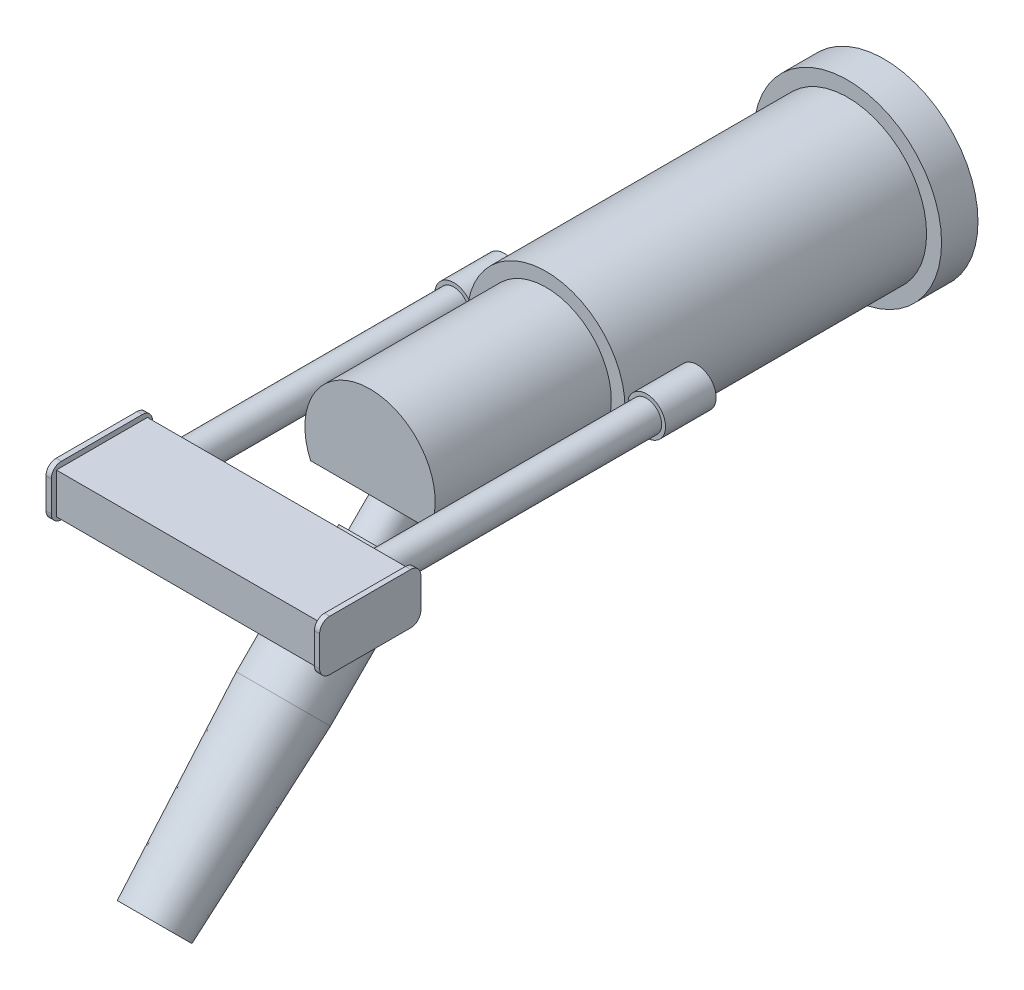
from build123d import *

# Parameters (mm, degrees)
SKETCH1_R          = 58.928
EXTRUDE1_DEPTH     = 22.86
SKETCH2_R          = 49.53
EXTRUDE2_DEPTH     = 189.23
SKETCH3_R          = 40.894
EXTRUDE3_DEPTH     = 110.49
SKETCH4_R          = 28.0035
CUT_EXTRUDE1_DEPTH = 77.851
SKETCH10_R         = 11.938
EXTRUDE9_DEPTH     = 31.75
SKETCH7_R          = 9.525
EXTRUDE6_DEPTH     = 170.18
SKETCH8_W          = 165.1
SKETCH8_H          = 25.4
EXTRUDE7_DEPTH     = 57.15
EXTRUDE8_DEPTH     = 3.302
CUT_EXTRUDE2_START = -37.299967
CUT_EXTRUDE2_DEPTH = 74.599934


with BuildPart() as part:
    # Sketch1 → Extrude1 (new body)
    with BuildSketch(Plane.XY):
        Circle(SKETCH1_R)
    extrude(amount=EXTRUDE1_DEPTH)

    # Sketch2 → Extrude2 (add)
    with BuildSketch(Plane.XY.offset(22.86)):
        Circle(SKETCH2_R)
    extrude(amount=EXTRUDE2_DEPTH)

    # Sketch4 → Cut-Extrude1 (cut)
    with BuildSketch(Plane(origin=(0, 0, 0), x_dir=(-1, 0, 0), z_dir=(0, 0, -1))):
        Circle(SKETCH4_R)
    extrude(amount=-CUT_EXTRUDE1_DEPTH, mode=Mode.SUBTRACT)


with BuildPart() as body_2:
    # Sketch3 → Extrude3 (new body)
    with BuildSketch(Plane.XY.offset(212.09)):
        Circle(SKETCH3_R)
    extrude(amount=EXTRUDE3_DEPTH)

    # Sketch11 → Cut-Extrude2 (cut)
    with BuildSketch(Plane(origin=(0, 0, 0), x_dir=(0, 0, -1), z_dir=(1, 0, 0)).offset(CUT_EXTRUDE2_START)):
        Polygon((-324.559129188, -14.784870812), (-298.45, -40.894), (-324.559129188, -40.894), align=None)
    extrude(amount=CUT_EXTRUDE2_DEPTH, mode=Mode.SUBTRACT)


with BuildPart() as body_3:
    # Sketch10 → Extrude9 (new body)
    with BuildSketch(Plane.XY.offset(177.8)):
        with Locations((60.452, 0)):
            Circle(SKETCH10_R)
    extrude(amount=EXTRUDE9_DEPTH)


with BuildPart() as body_4:
    # Sketch7 → Extrude6 (new body)
    with BuildSketch(Plane.XY.offset(209.55)):
        with Locations((60.452, 0)):
            Circle(SKETCH7_R)
    extrude(amount=EXTRUDE6_DEPTH)


with BuildPart() as body_5:
    # Sketch8 → Extrude7 (new body)
    with BuildSketch(Plane.XY.offset(379.73)):
        Rectangle(SKETCH8_W, SKETCH8_H)
    extrude(amount=EXTRUDE7_DEPTH)


with BuildPart() as body_6:
    # Sketch9 → Extrude8 (new body)
    with BuildSketch(Plane(origin=(82.55, 0, 0), x_dir=(0, 0, -1), z_dir=(1, 0, 0))):
        with BuildLine():
            Line((-376.555, -9.525), (-376.555, 9.525))
            ThreePointArc((-376.555, 9.525), (-378.414871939, 14.015128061), (-382.905, 15.875))
            Line((-382.905, 15.875), (-433.705, 15.875))
            ThreePointArc((-433.705, 15.875), (-438.195128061, 14.015128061), (-440.055, 9.525))
            Line((-440.055, 9.525), (-440.055, -9.525))
            ThreePointArc((-440.055, -9.525), (-438.195128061, -14.015128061), (-433.705, -15.875))
            Line((-433.705, -15.875), (-382.905, -15.875))
            ThreePointArc((-382.905, -15.875), (-378.414871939, -14.015128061), (-376.555, -9.525))
        make_face()
    extrude(amount=EXTRUDE8_DEPTH)


with BuildPart() as body_7:
    # Mirror1: mirrored copy
    add(body_3.part.mirror(Plane(origin=(0, 0, 0), x_dir=(0, 0, 1), z_dir=(1, 0, 0))))


with BuildPart() as body_8:
    # Mirror1 2: mirrored copy
    add(body_4.part.mirror(Plane(origin=(0, 0, 0), x_dir=(0, 0, 1), z_dir=(1, 0, 0))))


with BuildPart() as body_9:
    # Mirror1 3: mirrored copy
    add(body_6.part.mirror(Plane(origin=(0, 0, 0), x_dir=(0, 0, 1), z_dir=(1, 0, 0))))


with BuildPart() as body_10:
    # Sketch12 → Revolve1 (revolve)
    with BuildSketch(Plane(origin=(0, 0, 0), x_dir=(0, 0, -1), z_dir=(1, 0, 0)), mode=Mode.PRIVATE) as revolve1_sk:
        Polygon((-307.34, -30.8356), (-457.759290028, -181.254890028), (-471.292998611, -167.721181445), (-393.999471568, -83.370098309), (-340.117934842, -29.488561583), (-335.403300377, -34.203196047), (-333.158236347, -31.958132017), (-329.700837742, -35.415530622), (-316.23045356, -21.94514644), align=None)
    revolve(revolve1_sk.sketch.rotate(Axis((0, -100.432584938, 376.936984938), (0, 0.7071067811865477, -0.7071067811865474)), 180), axis=Axis((0, -100.432584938, 376.936984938), (0, 0.7071067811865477, -0.7071067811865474)))


solid = Compound([part.part, body_2.part, body_3.part, body_4.part, body_5.part, body_6.part, body_7.part, body_8.part, body_9.part, body_10.part])
